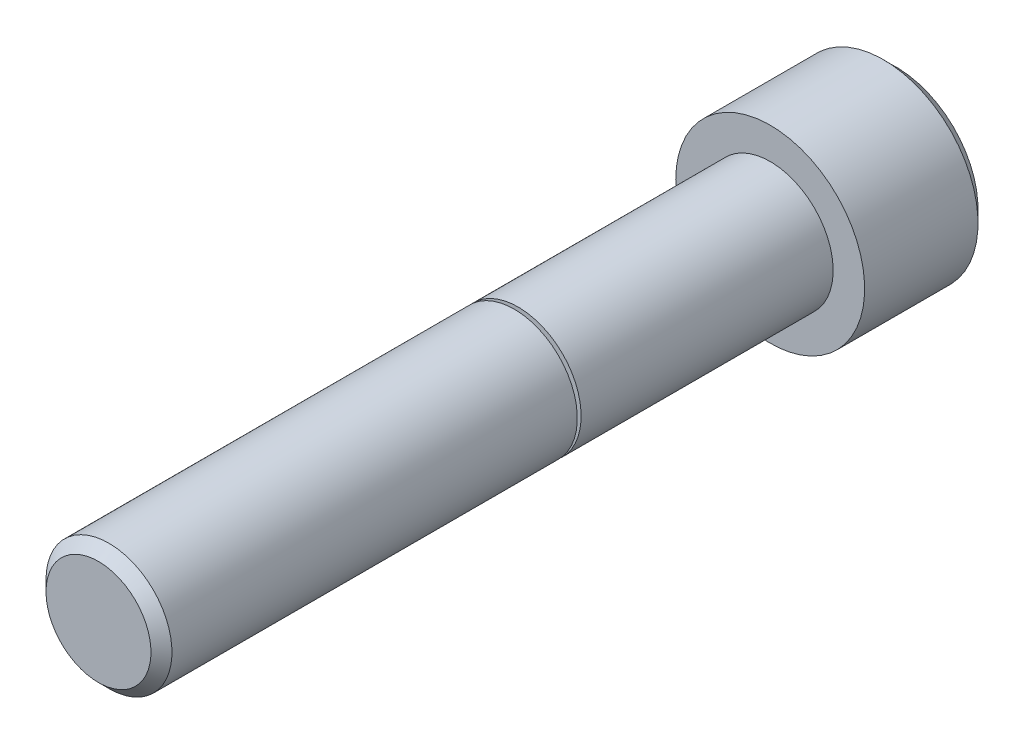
from build123d import *

# Parameters (mm, degrees)
CUT_EXTRUDE1_DEPTH = 4.7625


with BuildPart() as part:
    # Logo3_bib1 → Revolve1 (revolve)
    with BuildSketch(Plane(origin=(0, 0, 0), x_dir=(-1, 0, 0), z_dir=(0, -1, 0))):
        with BuildLine():
            Line((0, -50.8), (0, 9.525))
            Line((0, 9.525), (6.19125, 9.525))
            Line((6.19125, 9.525), (7.14375, 8.5725))
            Line((7.14375, 8.5725), (7.14375, 0))
            Line((7.14375, 0), (4.7625, 0))
            Line((4.7625, 0), (4.7625, -19.06))
            Line((4.7625, -19.06), (4.082175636, -19.06))
            ThreePointArc((4.082175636, -19.06), (4.062479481, -19.076527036), (4.075335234, -19.098793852))
            Line((4.075335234, -19.098793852), (4.7625, -19.348901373))
            Line((4.7625, -19.348901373), (4.7625, -50.00625))
            Line((4.7625, -50.00625), (3.96875, -50.8))
            Line((3.96875, -50.8), (0, -50.8))
        make_face()
    revolve(axis=Axis((0, 0, -10.585154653), (0, 0, 1)))

    # Logo3_bib2 → Cut-Extrude1 (cut)
    with BuildSketch(Plane(origin=(0, 0, -9.525), x_dir=(1, 0, 0), z_dir=(0, 0, -1))):
        Polygon((4.575385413, 0), (2.287692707, 3.9624), (-2.287692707, 3.9624), (-4.575385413, 0), (-2.287692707, -3.9624), (2.287692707, -3.9624), align=None)
    extrude(amount=-CUT_EXTRUDE1_DEPTH, mode=Mode.SUBTRACT)


solid = part.part
